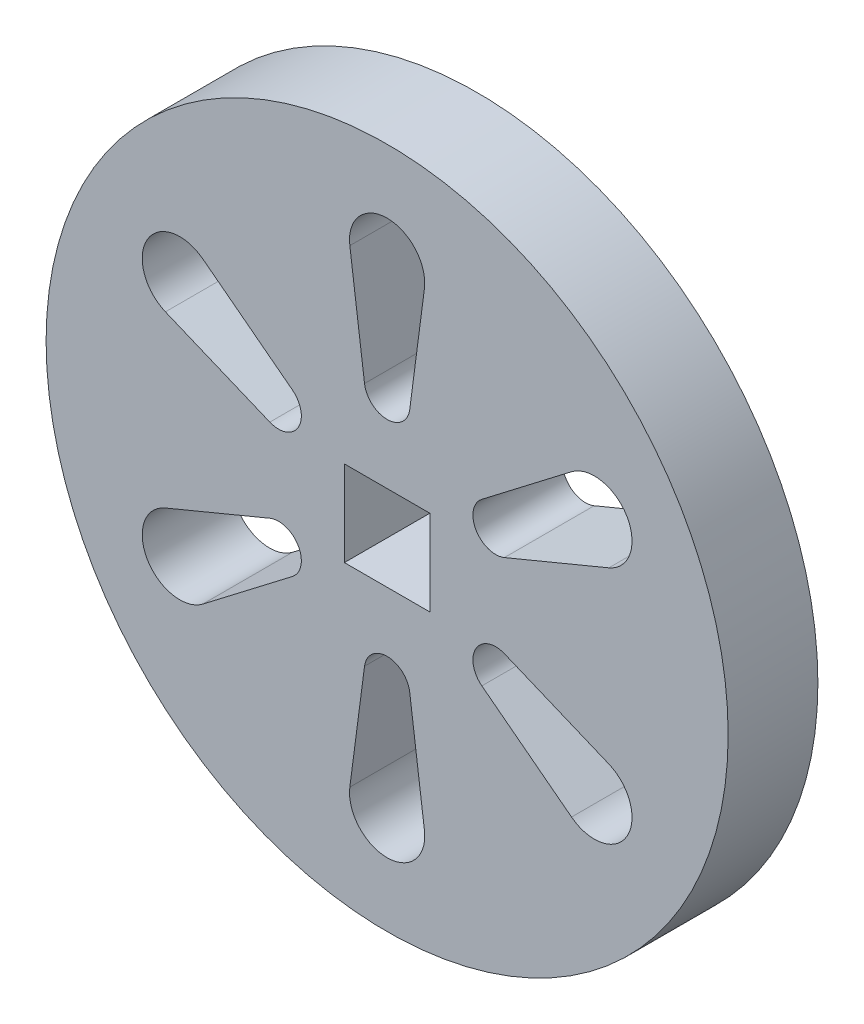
ISO-10303-21;
HEADER;
FILE_DESCRIPTION(('STEP AP214'),'2;1');
FILE_NAME('part.step','',(''),(''),'','','');
FILE_SCHEMA(('AUTOMOTIVE_DESIGN { 1 0 10303 214 1 1 1 1 }'));
ENDSEC;
DATA;
#1=APPLICATION_CONTEXT('core data for automotive mechanical design processes');
#2=APPLICATION_PROTOCOL_DEFINITION('international standard','automotive_design',2000,#1);
#3=PRODUCT_CONTEXT('',#1,'mechanical');
#4=PRODUCT('Part','Part','',(#3));
#5=PRODUCT_RELATED_PRODUCT_CATEGORY('part','',(#4));
#6=PRODUCT_DEFINITION_FORMATION('','',#4);
#7=PRODUCT_DEFINITION_CONTEXT('part definition',#1,'design');
#8=PRODUCT_DEFINITION('design','',#6,#7);
#9=PRODUCT_DEFINITION_SHAPE('','',#8);
#10=(LENGTH_UNIT() NAMED_UNIT(*) SI_UNIT(.MILLI.,.METRE.));
#11=(NAMED_UNIT(*) PLANE_ANGLE_UNIT() SI_UNIT($,.RADIAN.));
#12=(NAMED_UNIT(*) SI_UNIT($,.STERADIAN.) SOLID_ANGLE_UNIT());
#13=UNCERTAINTY_MEASURE_WITH_UNIT(LENGTH_MEASURE(1.E-05),#10,'distance_accuracy_value','');
#14=(GEOMETRIC_REPRESENTATION_CONTEXT(3) GLOBAL_UNCERTAINTY_ASSIGNED_CONTEXT((#13)) GLOBAL_UNIT_ASSIGNED_CONTEXT((#10,
#11,#12)) REPRESENTATION_CONTEXT('',''));
#15=CARTESIAN_POINT('',(0.,0.,0.));
#16=DIRECTION('',(0.,0.,1.));
#17=DIRECTION('',(1.,0.,0.));
#18=AXIS2_PLACEMENT_3D('',#15,#16,#17);
#19=CARTESIAN_POINT('',(0.,0.,10.));
#20=DIRECTION('',(0.,0.,1.));
#21=DIRECTION('',(1.,0.,0.));
#22=AXIS2_PLACEMENT_3D('',#19,#20,#21);
#23=PLANE('',#22);
#24=DIRECTION('',(0.,1.,0.));
#25=VECTOR('',#24,1.);
#26=CARTESIAN_POINT('',(4.7625,4.7625,10.));
#27=LINE('',#26,#25);
#28=CARTESIAN_POINT('',(4.7625,-4.7625,10.));
#29=VERTEX_POINT('',#28);
#30=CARTESIAN_POINT('',(4.7625,4.7625,10.));
#31=VERTEX_POINT('',#30);
#32=EDGE_CURVE('E411',#29,#31,#27,.T.);
#33=ORIENTED_EDGE('',*,*,#32,.F.);
#34=DIRECTION('',(1.,0.,0.));
#35=VECTOR('',#34,1.);
#36=CARTESIAN_POINT('',(-4.7625,-4.7625,10.));
#37=LINE('',#36,#35);
#38=CARTESIAN_POINT('',(-4.7625,-4.7625,10.));
#39=VERTEX_POINT('',#38);
#40=EDGE_CURVE('E303',#39,#29,#37,.T.);
#41=ORIENTED_EDGE('',*,*,#40,.F.);
#42=DIRECTION('',(0.,-1.,0.));
#43=VECTOR('',#42,1.);
#44=CARTESIAN_POINT('',(-4.7625,4.7625,10.));
#45=LINE('',#44,#43);
#46=CARTESIAN_POINT('',(-4.7625,4.7625,10.));
#47=VERTEX_POINT('',#46);
#48=EDGE_CURVE('E421',#47,#39,#45,.T.);
#49=ORIENTED_EDGE('',*,*,#48,.F.);
#50=DIRECTION('',(-1.,0.,0.));
#51=VECTOR('',#50,1.);
#52=CARTESIAN_POINT('',(-4.7625,4.7625,10.));
#53=LINE('',#52,#51);
#54=EDGE_CURVE('E413',#31,#47,#53,.T.);
#55=ORIENTED_EDGE('',*,*,#54,.F.);
#56=EDGE_LOOP('',(#33,#41,#49,#55));
#57=FACE_BOUND('',#56,.T.);
#58=CARTESIAN_POINT('',(0.,0.,10.));
#59=DIRECTION('',(0.,0.,1.));
#60=DIRECTION('',(1.,0.,0.));
#61=AXIS2_PLACEMENT_3D('',#58,#59,#60);
#62=CIRCLE('',#61,38.);
#63=CARTESIAN_POINT('',(38.,0.,10.));
#64=VERTEX_POINT('',#63);
#65=EDGE_CURVE('E12',#64,#64,#62,.T.);
#66=ORIENTED_EDGE('',*,*,#65,.T.);
#67=EDGE_LOOP('',(#66));
#68=FACE_BOUND('',#67,.T.);
#69=DIRECTION('',(0.13,-0.99151399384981,0.));
#70=VECTOR('',#69,1.);
#71=CARTESIAN_POINT('',(-4.15543514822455,26.12517,10.));
#72=LINE('',#71,#70);
#73=CARTESIAN_POINT('',(-4.15543514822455,26.12517,10.));
#74=VERTEX_POINT('',#73);
#75=CARTESIAN_POINT('',(-2.51844554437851,13.6398,10.));
#76=VERTEX_POINT('',#75);
#77=EDGE_CURVE('E871',#74,#76,#72,.T.);
#78=ORIENTED_EDGE('',*,*,#77,.F.);
#79=CARTESIAN_POINT('',(0.,26.67,10.));
#80=DIRECTION('',(0.,0.,-1.));
#81=DIRECTION('',(-1.,0.,0.));
#82=AXIS2_PLACEMENT_3D('',#79,#80,#81);
#83=CIRCLE('',#82,4.191);
#84=CARTESIAN_POINT('',(4.15543514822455,26.12517,10.));
#85=VERTEX_POINT('',#84);
#86=EDGE_CURVE('E824',#74,#85,#83,.T.);
#87=ORIENTED_EDGE('',*,*,#86,.T.);
#88=DIRECTION('',(-0.13,-0.991513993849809,0.));
#89=VECTOR('',#88,1.);
#90=CARTESIAN_POINT('',(4.15543514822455,26.12517,10.));
#91=LINE('',#90,#89);
#92=CARTESIAN_POINT('',(2.51844554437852,13.6398,10.));
#93=VERTEX_POINT('',#92);
#94=EDGE_CURVE('E829',#85,#93,#91,.T.);
#95=ORIENTED_EDGE('',*,*,#94,.T.);
#96=CARTESIAN_POINT('',(0.,13.97,10.));
#97=DIRECTION('',(0.,0.,1.));
#98=DIRECTION('',(1.,0.,0.));
#99=AXIS2_PLACEMENT_3D('',#96,#97,#98);
#100=CIRCLE('',#99,2.54);
#101=EDGE_CURVE('E855',#76,#93,#100,.T.);
#102=ORIENTED_EDGE('',*,*,#101,.F.);
#103=EDGE_LOOP('',(#78,#87,#95,#102));
#104=FACE_BOUND('',#103,.T.);
#105=DIRECTION('',(0.923676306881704,-0.383173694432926,0.));
#106=VECTOR('',#105,1.);
#107=CARTESIAN_POINT('',(-24.7027784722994,9.46387259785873,10.));
#108=LINE('',#107,#106);
#109=CARTESIAN_POINT('',(-24.7027784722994,9.46387259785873,10.));
#110=VERTEX_POINT('',#109);
#111=CARTESIAN_POINT('',(-13.0716360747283,4.63886218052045,10.));
#112=VERTEX_POINT('',#111);
#113=EDGE_CURVE('E403',#110,#112,#108,.T.);
#114=ORIENTED_EDGE('',*,*,#113,.F.);
#115=CARTESIAN_POINT('',(-23.096897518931,13.3349999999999,10.));
#116=DIRECTION('',(0.,0.,-1.));
#117=DIRECTION('',(-0.499999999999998,-0.86602540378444,0.));
#118=AXIS2_PLACEMENT_3D('',#115,#116,#117);
#119=CIRCLE('',#118,4.191);
#120=CARTESIAN_POINT('',(-20.5473433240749,16.6612974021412,10.));
#121=VERTEX_POINT('',#120);
#122=EDGE_CURVE('E825',#110,#121,#119,.T.);
#123=ORIENTED_EDGE('',*,*,#122,.T.);
#124=DIRECTION('',(0.793676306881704,-0.60834029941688,0.));
#125=VECTOR('',#124,1.);
#126=CARTESIAN_POINT('',(-20.5473433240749,16.6612974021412,10.));
#127=LINE('',#126,#125);
#128=CARTESIAN_POINT('',(-10.5531905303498,9.0009378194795,10.));
#129=VERTEX_POINT('',#128);
#130=EDGE_CURVE('E929',#121,#129,#127,.T.);
#131=ORIENTED_EDGE('',*,*,#130,.T.);
#132=CARTESIAN_POINT('',(-12.0983748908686,6.98499999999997,10.));
#133=DIRECTION('',(0.,0.,1.));
#134=DIRECTION('',(0.499999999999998,0.86602540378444,0.));
#135=AXIS2_PLACEMENT_3D('',#132,#133,#134);
#136=CIRCLE('',#135,2.54);
#137=EDGE_CURVE('E908',#112,#129,#136,.T.);
#138=ORIENTED_EDGE('',*,*,#137,.F.);
#139=EDGE_LOOP('',(#114,#123,#131,#138));
#140=FACE_BOUND('',#139,.T.);
#141=DIRECTION('',(0.7936763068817,0.608340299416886,0.));
#142=VECTOR('',#141,1.);
#143=CARTESIAN_POINT('',(-20.5473433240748,-16.6612974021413,10.));
#144=LINE('',#143,#142);
#145=CARTESIAN_POINT('',(-20.5473433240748,-16.6612974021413,10.));
#146=VERTEX_POINT('',#145);
#147=CARTESIAN_POINT('',(-10.5531905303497,-9.00093781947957,10.));
#148=VERTEX_POINT('',#147);
#149=EDGE_CURVE('E234',#146,#148,#144,.T.);
#150=ORIENTED_EDGE('',*,*,#149,.F.);
#151=CARTESIAN_POINT('',(-23.0968975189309,-13.3350000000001,10.));
#152=DIRECTION('',(0.,0.,-1.));
#153=DIRECTION('',(0.500000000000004,-0.866025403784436,0.));
#154=AXIS2_PLACEMENT_3D('',#151,#152,#153);
#155=CIRCLE('',#154,4.191);
#156=CARTESIAN_POINT('',(-24.7027784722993,-9.4638725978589,10.));
#157=VERTEX_POINT('',#156);
#158=EDGE_CURVE('E404',#146,#157,#155,.T.);
#159=ORIENTED_EDGE('',*,*,#158,.T.);
#160=DIRECTION('',(0.923676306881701,0.383173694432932,0.));
#161=VECTOR('',#160,1.);
#162=CARTESIAN_POINT('',(-24.7027784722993,-9.4638725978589,10.));
#163=LINE('',#162,#161);
#164=CARTESIAN_POINT('',(-13.0716360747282,-4.63886218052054,10.));
#165=VERTEX_POINT('',#164);
#166=EDGE_CURVE('E256',#157,#165,#163,.T.);
#167=ORIENTED_EDGE('',*,*,#166,.T.);
#168=CARTESIAN_POINT('',(-12.0983748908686,-6.98500000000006,10.));
#169=DIRECTION('',(0.,0.,1.));
#170=DIRECTION('',(-0.500000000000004,0.866025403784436,0.));
#171=AXIS2_PLACEMENT_3D('',#168,#169,#170);
#172=CIRCLE('',#171,2.54);
#173=EDGE_CURVE('E249',#148,#165,#172,.T.);
#174=ORIENTED_EDGE('',*,*,#173,.F.);
#175=EDGE_LOOP('',(#150,#159,#167,#174));
#176=FACE_BOUND('',#175,.T.);
#177=DIRECTION('',(-0.13,0.99151399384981,0.));
#178=VECTOR('',#177,1.);
#179=CARTESIAN_POINT('',(4.15543514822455,-26.12517,10.));
#180=LINE('',#179,#178);
#181=CARTESIAN_POINT('',(4.15543514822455,-26.12517,10.));
#182=VERTEX_POINT('',#181);
#183=CARTESIAN_POINT('',(2.51844554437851,-13.6398,10.));
#184=VERTEX_POINT('',#183);
#185=EDGE_CURVE('E392',#182,#184,#180,.T.);
#186=ORIENTED_EDGE('',*,*,#185,.F.);
#187=CARTESIAN_POINT('',(0.,-26.67,10.));
#188=DIRECTION('',(0.,0.,-1.));
#189=DIRECTION('',(1.,0.,0.));
#190=AXIS2_PLACEMENT_3D('',#187,#188,#189);
#191=CIRCLE('',#190,4.191);
#192=CARTESIAN_POINT('',(-4.15543514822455,-26.12517,10.));
#193=VERTEX_POINT('',#192);
#194=EDGE_CURVE('E344',#182,#193,#191,.T.);
#195=ORIENTED_EDGE('',*,*,#194,.T.);
#196=DIRECTION('',(0.13,0.991513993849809,0.));
#197=VECTOR('',#196,1.);
#198=CARTESIAN_POINT('',(-4.15543514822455,-26.12517,10.));
#199=LINE('',#198,#197);
#200=CARTESIAN_POINT('',(-2.51844554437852,-13.6398,10.));
#201=VERTEX_POINT('',#200);
#202=EDGE_CURVE('E364',#193,#201,#199,.T.);
#203=ORIENTED_EDGE('',*,*,#202,.T.);
#204=CARTESIAN_POINT('',(0.,-13.97,10.));
#205=DIRECTION('',(0.,0.,1.));
#206=DIRECTION('',(-1.,0.,0.));
#207=AXIS2_PLACEMENT_3D('',#204,#205,#206);
#208=CIRCLE('',#207,2.54);
#209=EDGE_CURVE('E331',#184,#201,#208,.T.);
#210=ORIENTED_EDGE('',*,*,#209,.F.);
#211=EDGE_LOOP('',(#186,#195,#203,#210));
#212=FACE_BOUND('',#211,.T.);
#213=DIRECTION('',(-0.923676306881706,0.383173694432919,0.));
#214=VECTOR('',#213,1.);
#215=CARTESIAN_POINT('',(24.7027784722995,-9.46387259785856,10.));
#216=LINE('',#215,#214);
#217=CARTESIAN_POINT('',(24.7027784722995,-9.46387259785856,10.));
#218=VERTEX_POINT('',#217);
#219=CARTESIAN_POINT('',(13.0716360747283,-4.63886218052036,10.));
#220=VERTEX_POINT('',#219);
#221=EDGE_CURVE('E356',#218,#220,#216,.T.);
#222=ORIENTED_EDGE('',*,*,#221,.F.);
#223=CARTESIAN_POINT('',(23.0968975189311,-13.3349999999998,10.));
#224=DIRECTION('',(0.,0.,-1.));
#225=DIRECTION('',(0.499999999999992,0.866025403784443,0.));
#226=AXIS2_PLACEMENT_3D('',#223,#224,#225);
#227=CIRCLE('',#226,4.191);
#228=CARTESIAN_POINT('',(20.547343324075,-16.661297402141,10.));
#229=VERTEX_POINT('',#228);
#230=EDGE_CURVE('E67',#218,#229,#227,.T.);
#231=ORIENTED_EDGE('',*,*,#230,.T.);
#232=DIRECTION('',(-0.793676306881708,0.608340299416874,0.));
#233=VECTOR('',#232,1.);
#234=CARTESIAN_POINT('',(20.547343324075,-16.661297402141,10.));
#235=LINE('',#234,#233);
#236=CARTESIAN_POINT('',(10.5531905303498,-9.00093781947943,10.));
#237=VERTEX_POINT('',#236);
#238=EDGE_CURVE('E965',#229,#237,#235,.T.);
#239=ORIENTED_EDGE('',*,*,#238,.T.);
#240=CARTESIAN_POINT('',(12.0983748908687,-6.98499999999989,10.));
#241=DIRECTION('',(0.,0.,1.));
#242=DIRECTION('',(-0.499999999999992,-0.866025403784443,0.));
#243=AXIS2_PLACEMENT_3D('',#240,#241,#242);
#244=CIRCLE('',#243,2.54);
#245=EDGE_CURVE('E959',#220,#237,#244,.T.);
#246=ORIENTED_EDGE('',*,*,#245,.F.);
#247=EDGE_LOOP('',(#222,#231,#239,#246));
#248=FACE_BOUND('',#247,.T.);
#249=DIRECTION('',(-0.793676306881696,-0.608340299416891,0.));
#250=VECTOR('',#249,1.);
#251=CARTESIAN_POINT('',(20.5473433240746,16.6612974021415,10.));
#252=LINE('',#251,#250);
#253=CARTESIAN_POINT('',(20.5473433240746,16.6612974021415,10.));
#254=VERTEX_POINT('',#253);
#255=CARTESIAN_POINT('',(10.5531905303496,9.00093781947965,10.));
#256=VERTEX_POINT('',#255);
#257=EDGE_CURVE('E1102',#254,#256,#252,.T.);
#258=ORIENTED_EDGE('',*,*,#257,.F.);
#259=CARTESIAN_POINT('',(23.0968975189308,13.3350000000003,10.));
#260=DIRECTION('',(0.,0.,-1.));
#261=DIRECTION('',(-0.50000000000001,0.866025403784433,0.));
#262=AXIS2_PLACEMENT_3D('',#259,#260,#261);
#263=CIRCLE('',#262,4.191);
#264=CARTESIAN_POINT('',(24.7027784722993,9.46387259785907,10.));
#265=VERTEX_POINT('',#264);
#266=EDGE_CURVE('E59',#254,#265,#263,.T.);
#267=ORIENTED_EDGE('',*,*,#266,.T.);
#268=DIRECTION('',(-0.923676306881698,-0.383173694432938,0.));
#269=VECTOR('',#268,1.);
#270=CARTESIAN_POINT('',(24.7027784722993,9.46387259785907,10.));
#271=LINE('',#270,#269);
#272=CARTESIAN_POINT('',(13.0716360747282,4.63886218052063,10.));
#273=VERTEX_POINT('',#272);
#274=EDGE_CURVE('E1116',#265,#273,#271,.T.);
#275=ORIENTED_EDGE('',*,*,#274,.T.);
#276=CARTESIAN_POINT('',(12.0983748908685,6.98500000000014,10.));
#277=DIRECTION('',(0.,0.,1.));
#278=DIRECTION('',(0.50000000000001,-0.866025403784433,0.));
#279=AXIS2_PLACEMENT_3D('',#276,#277,#278);
#280=CIRCLE('',#279,2.54);
#281=EDGE_CURVE('E1135',#256,#273,#280,.T.);
#282=ORIENTED_EDGE('',*,*,#281,.F.);
#283=EDGE_LOOP('',(#258,#267,#275,#282));
#284=FACE_BOUND('',#283,.T.);
#285=ADVANCED_FACE('F44',(#57,#68,#104,#140,#176,#212,#248,#284),#23,.T.);
#286=CARTESIAN_POINT('',(0.,0.,0.));
#287=DIRECTION('',(0.,0.,1.));
#288=DIRECTION('',(1.,0.,0.));
#289=AXIS2_PLACEMENT_3D('',#286,#287,#288);
#290=PLANE('',#289);
#291=CARTESIAN_POINT('',(23.0968975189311,-13.3349999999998,0.));
#292=DIRECTION('',(0.,0.,-1.));
#293=DIRECTION('',(0.499999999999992,0.866025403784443,0.));
#294=AXIS2_PLACEMENT_3D('',#291,#292,#293);
#295=CIRCLE('',#294,4.191);
#296=CARTESIAN_POINT('',(24.7027784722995,-9.46387259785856,0.));
#297=VERTEX_POINT('',#296);
#298=CARTESIAN_POINT('',(20.547343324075,-16.661297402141,0.));
#299=VERTEX_POINT('',#298);
#300=EDGE_CURVE('E393',#297,#299,#295,.T.);
#301=ORIENTED_EDGE('',*,*,#300,.F.);
#302=DIRECTION('',(-0.923676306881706,0.383173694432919,0.));
#303=VECTOR('',#302,1.);
#304=CARTESIAN_POINT('',(24.7027784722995,-9.46387259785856,0.));
#305=LINE('',#304,#303);
#306=CARTESIAN_POINT('',(13.0716360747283,-4.63886218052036,0.));
#307=VERTEX_POINT('',#306);
#308=EDGE_CURVE('E1151',#297,#307,#305,.T.);
#309=ORIENTED_EDGE('',*,*,#308,.T.);
#310=CARTESIAN_POINT('',(12.0983748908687,-6.98499999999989,0.));
#311=DIRECTION('',(0.,0.,1.));
#312=DIRECTION('',(-0.499999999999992,-0.866025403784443,0.));
#313=AXIS2_PLACEMENT_3D('',#310,#311,#312);
#314=CIRCLE('',#313,2.54);
#315=CARTESIAN_POINT('',(10.5531905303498,-9.00093781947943,0.));
#316=VERTEX_POINT('',#315);
#317=EDGE_CURVE('E958',#307,#316,#314,.T.);
#318=ORIENTED_EDGE('',*,*,#317,.T.);
#319=DIRECTION('',(-0.793676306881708,0.608340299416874,0.));
#320=VECTOR('',#319,1.);
#321=CARTESIAN_POINT('',(20.547343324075,-16.661297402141,0.));
#322=LINE('',#321,#320);
#323=EDGE_CURVE('E974',#299,#316,#322,.T.);
#324=ORIENTED_EDGE('',*,*,#323,.F.);
#325=EDGE_LOOP('',(#301,#309,#318,#324));
#326=FACE_BOUND('',#325,.T.);
#327=CARTESIAN_POINT('',(-23.0968975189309,-13.3350000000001,0.));
#328=DIRECTION('',(0.,0.,-1.));
#329=DIRECTION('',(0.500000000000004,-0.866025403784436,0.));
#330=AXIS2_PLACEMENT_3D('',#327,#328,#329);
#331=CIRCLE('',#330,4.191);
#332=CARTESIAN_POINT('',(-20.5473433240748,-16.6612974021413,0.));
#333=VERTEX_POINT('',#332);
#334=CARTESIAN_POINT('',(-24.7027784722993,-9.4638725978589,0.));
#335=VERTEX_POINT('',#334);
#336=EDGE_CURVE('E399',#333,#335,#331,.T.);
#337=ORIENTED_EDGE('',*,*,#336,.F.);
#338=DIRECTION('',(0.7936763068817,0.608340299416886,0.));
#339=VECTOR('',#338,1.);
#340=CARTESIAN_POINT('',(-20.5473433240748,-16.6612974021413,0.));
#341=LINE('',#340,#339);
#342=CARTESIAN_POINT('',(-10.5531905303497,-9.00093781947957,0.));
#343=VERTEX_POINT('',#342);
#344=EDGE_CURVE('E244',#333,#343,#341,.T.);
#345=ORIENTED_EDGE('',*,*,#344,.T.);
#346=CARTESIAN_POINT('',(-12.0983748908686,-6.98500000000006,0.));
#347=DIRECTION('',(0.,0.,1.));
#348=DIRECTION('',(-0.500000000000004,0.866025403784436,0.));
#349=AXIS2_PLACEMENT_3D('',#346,#347,#348);
#350=CIRCLE('',#349,2.54);
#351=CARTESIAN_POINT('',(-13.0716360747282,-4.63886218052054,0.));
#352=VERTEX_POINT('',#351);
#353=EDGE_CURVE('E252',#343,#352,#350,.T.);
#354=ORIENTED_EDGE('',*,*,#353,.T.);
#355=DIRECTION('',(0.923676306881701,0.383173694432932,0.));
#356=VECTOR('',#355,1.);
#357=CARTESIAN_POINT('',(-24.7027784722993,-9.4638725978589,0.));
#358=LINE('',#357,#356);
#359=EDGE_CURVE('E287',#335,#352,#358,.T.);
#360=ORIENTED_EDGE('',*,*,#359,.F.);
#361=EDGE_LOOP('',(#337,#345,#354,#360));
#362=FACE_BOUND('',#361,.T.);
#363=CARTESIAN_POINT('',(0.,26.67,0.));
#364=DIRECTION('',(0.,0.,-1.));
#365=DIRECTION('',(-1.,0.,0.));
#366=AXIS2_PLACEMENT_3D('',#363,#364,#365);
#367=CIRCLE('',#366,4.191);
#368=CARTESIAN_POINT('',(-4.15543514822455,26.12517,0.));
#369=VERTEX_POINT('',#368);
#370=CARTESIAN_POINT('',(4.15543514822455,26.12517,0.));
#371=VERTEX_POINT('',#370);
#372=EDGE_CURVE('E837',#369,#371,#367,.T.);
#373=ORIENTED_EDGE('',*,*,#372,.F.);
#374=DIRECTION('',(0.13,-0.99151399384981,0.));
#375=VECTOR('',#374,1.);
#376=CARTESIAN_POINT('',(-4.15543514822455,26.12517,0.));
#377=LINE('',#376,#375);
#378=CARTESIAN_POINT('',(-2.51844554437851,13.6398,0.));
#379=VERTEX_POINT('',#378);
#380=EDGE_CURVE('E850',#369,#379,#377,.T.);
#381=ORIENTED_EDGE('',*,*,#380,.T.);
#382=CARTESIAN_POINT('',(0.,13.97,0.));
#383=DIRECTION('',(0.,0.,1.));
#384=DIRECTION('',(1.,0.,0.));
#385=AXIS2_PLACEMENT_3D('',#382,#383,#384);
#386=CIRCLE('',#385,2.54);
#387=CARTESIAN_POINT('',(2.51844554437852,13.6398,0.));
#388=VERTEX_POINT('',#387);
#389=EDGE_CURVE('E863',#379,#388,#386,.T.);
#390=ORIENTED_EDGE('',*,*,#389,.T.);
#391=DIRECTION('',(-0.13,-0.991513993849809,0.));
#392=VECTOR('',#391,1.);
#393=CARTESIAN_POINT('',(4.15543514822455,26.12517,0.));
#394=LINE('',#393,#392);
#395=EDGE_CURVE('E866',#371,#388,#394,.T.);
#396=ORIENTED_EDGE('',*,*,#395,.F.);
#397=EDGE_LOOP('',(#373,#381,#390,#396));
#398=FACE_BOUND('',#397,.T.);
#399=DIRECTION('',(1.,0.,0.));
#400=VECTOR('',#399,1.);
#401=CARTESIAN_POINT('',(-4.7625,-4.7625,0.));
#402=LINE('',#401,#400);
#403=CARTESIAN_POINT('',(-4.7625,-4.7625,0.));
#404=VERTEX_POINT('',#403);
#405=CARTESIAN_POINT('',(4.7625,-4.7625,0.));
#406=VERTEX_POINT('',#405);
#407=EDGE_CURVE('E415',#404,#406,#402,.T.);
#408=ORIENTED_EDGE('',*,*,#407,.T.);
#409=DIRECTION('',(0.,1.,0.));
#410=VECTOR('',#409,1.);
#411=CARTESIAN_POINT('',(4.7625,4.7625,0.));
#412=LINE('',#411,#410);
#413=CARTESIAN_POINT('',(4.7625,4.7625,0.));
#414=VERTEX_POINT('',#413);
#415=EDGE_CURVE('E430',#406,#414,#412,.T.);
#416=ORIENTED_EDGE('',*,*,#415,.T.);
#417=DIRECTION('',(-1.,0.,0.));
#418=VECTOR('',#417,1.);
#419=CARTESIAN_POINT('',(-4.7625,4.7625,0.));
#420=LINE('',#419,#418);
#421=CARTESIAN_POINT('',(-4.7625,4.7625,0.));
#422=VERTEX_POINT('',#421);
#423=EDGE_CURVE('E434',#414,#422,#420,.T.);
#424=ORIENTED_EDGE('',*,*,#423,.T.);
#425=DIRECTION('',(0.,-1.,0.));
#426=VECTOR('',#425,1.);
#427=CARTESIAN_POINT('',(-4.7625,4.7625,0.));
#428=LINE('',#427,#426);
#429=EDGE_CURVE('E440',#422,#404,#428,.T.);
#430=ORIENTED_EDGE('',*,*,#429,.T.);
#431=EDGE_LOOP('',(#408,#416,#424,#430));
#432=FACE_BOUND('',#431,.T.);
#433=CARTESIAN_POINT('',(0.,0.,0.));
#434=DIRECTION('',(0.,0.,1.));
#435=DIRECTION('',(1.,0.,0.));
#436=AXIS2_PLACEMENT_3D('',#433,#434,#435);
#437=CIRCLE('',#436,38.);
#438=CARTESIAN_POINT('',(38.,0.,0.));
#439=VERTEX_POINT('',#438);
#440=EDGE_CURVE('E48',#439,#439,#437,.T.);
#441=ORIENTED_EDGE('',*,*,#440,.F.);
#442=EDGE_LOOP('',(#441));
#443=FACE_BOUND('',#442,.T.);
#444=CARTESIAN_POINT('',(-23.096897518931,13.3349999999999,0.));
#445=DIRECTION('',(0.,0.,-1.));
#446=DIRECTION('',(-0.499999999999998,-0.86602540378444,0.));
#447=AXIS2_PLACEMENT_3D('',#444,#445,#446);
#448=CIRCLE('',#447,4.191);
#449=CARTESIAN_POINT('',(-24.7027784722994,9.46387259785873,0.));
#450=VERTEX_POINT('',#449);
#451=CARTESIAN_POINT('',(-20.5473433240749,16.6612974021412,0.));
#452=VERTEX_POINT('',#451);
#453=EDGE_CURVE('E817',#450,#452,#448,.T.);
#454=ORIENTED_EDGE('',*,*,#453,.F.);
#455=DIRECTION('',(0.923676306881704,-0.383173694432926,0.));
#456=VECTOR('',#455,1.);
#457=CARTESIAN_POINT('',(-24.7027784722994,9.46387259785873,0.));
#458=LINE('',#457,#456);
#459=CARTESIAN_POINT('',(-13.0716360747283,4.63886218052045,0.));
#460=VERTEX_POINT('',#459);
#461=EDGE_CURVE('E819',#450,#460,#458,.T.);
#462=ORIENTED_EDGE('',*,*,#461,.T.);
#463=CARTESIAN_POINT('',(-12.0983748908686,6.98499999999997,0.));
#464=DIRECTION('',(0.,0.,1.));
#465=DIRECTION('',(0.499999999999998,0.86602540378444,0.));
#466=AXIS2_PLACEMENT_3D('',#463,#464,#465);
#467=CIRCLE('',#466,2.54);
#468=CARTESIAN_POINT('',(-10.5531905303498,9.0009378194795,0.));
#469=VERTEX_POINT('',#468);
#470=EDGE_CURVE('E934',#460,#469,#467,.T.);
#471=ORIENTED_EDGE('',*,*,#470,.T.);
#472=DIRECTION('',(0.793676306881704,-0.60834029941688,0.));
#473=VECTOR('',#472,1.);
#474=CARTESIAN_POINT('',(-20.5473433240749,16.6612974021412,0.));
#475=LINE('',#474,#473);
#476=EDGE_CURVE('E821',#452,#469,#475,.T.);
#477=ORIENTED_EDGE('',*,*,#476,.F.);
#478=EDGE_LOOP('',(#454,#462,#471,#477));
#479=FACE_BOUND('',#478,.T.);
#480=CARTESIAN_POINT('',(0.,-26.67,0.));
#481=DIRECTION('',(0.,0.,-1.));
#482=DIRECTION('',(1.,0.,0.));
#483=AXIS2_PLACEMENT_3D('',#480,#481,#482);
#484=CIRCLE('',#483,4.191);
#485=CARTESIAN_POINT('',(4.15543514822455,-26.12517,0.));
#486=VERTEX_POINT('',#485);
#487=CARTESIAN_POINT('',(-4.15543514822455,-26.12517,0.));
#488=VERTEX_POINT('',#487);
#489=EDGE_CURVE('E245',#486,#488,#484,.T.);
#490=ORIENTED_EDGE('',*,*,#489,.F.);
#491=DIRECTION('',(-0.13,0.99151399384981,0.));
#492=VECTOR('',#491,1.);
#493=CARTESIAN_POINT('',(4.15543514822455,-26.12517,0.));
#494=LINE('',#493,#492);
#495=CARTESIAN_POINT('',(2.51844554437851,-13.6398,0.));
#496=VERTEX_POINT('',#495);
#497=EDGE_CURVE('E325',#486,#496,#494,.T.);
#498=ORIENTED_EDGE('',*,*,#497,.T.);
#499=CARTESIAN_POINT('',(0.,-13.97,0.));
#500=DIRECTION('',(0.,0.,1.));
#501=DIRECTION('',(-1.,0.,0.));
#502=AXIS2_PLACEMENT_3D('',#499,#500,#501);
#503=CIRCLE('',#502,2.54);
#504=CARTESIAN_POINT('',(-2.51844554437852,-13.6398,0.));
#505=VERTEX_POINT('',#504);
#506=EDGE_CURVE('E368',#496,#505,#503,.T.);
#507=ORIENTED_EDGE('',*,*,#506,.T.);
#508=DIRECTION('',(0.13,0.991513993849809,0.));
#509=VECTOR('',#508,1.);
#510=CARTESIAN_POINT('',(-4.15543514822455,-26.12517,0.));
#511=LINE('',#510,#509);
#512=EDGE_CURVE('E349',#488,#505,#511,.T.);
#513=ORIENTED_EDGE('',*,*,#512,.F.);
#514=EDGE_LOOP('',(#490,#498,#507,#513));
#515=FACE_BOUND('',#514,.T.);
#516=CARTESIAN_POINT('',(23.0968975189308,13.3350000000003,0.));
#517=DIRECTION('',(0.,0.,-1.));
#518=DIRECTION('',(-0.50000000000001,0.866025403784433,0.));
#519=AXIS2_PLACEMENT_3D('',#516,#517,#518);
#520=CIRCLE('',#519,4.191);
#521=CARTESIAN_POINT('',(20.5473433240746,16.6612974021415,0.));
#522=VERTEX_POINT('',#521);
#523=CARTESIAN_POINT('',(24.7027784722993,9.46387259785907,0.));
#524=VERTEX_POINT('',#523);
#525=EDGE_CURVE('E917',#522,#524,#520,.T.);
#526=ORIENTED_EDGE('',*,*,#525,.F.);
#527=DIRECTION('',(-0.793676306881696,-0.608340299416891,0.));
#528=VECTOR('',#527,1.);
#529=CARTESIAN_POINT('',(20.5473433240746,16.6612974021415,0.));
#530=LINE('',#529,#528);
#531=CARTESIAN_POINT('',(10.5531905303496,9.00093781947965,0.));
#532=VERTEX_POINT('',#531);
#533=EDGE_CURVE('E1105',#522,#532,#530,.T.);
#534=ORIENTED_EDGE('',*,*,#533,.T.);
#535=CARTESIAN_POINT('',(12.0983748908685,6.98500000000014,0.));
#536=DIRECTION('',(0.,0.,1.));
#537=DIRECTION('',(0.50000000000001,-0.866025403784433,0.));
#538=AXIS2_PLACEMENT_3D('',#535,#536,#537);
#539=CIRCLE('',#538,2.54);
#540=CARTESIAN_POINT('',(13.0716360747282,4.63886218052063,0.));
#541=VERTEX_POINT('',#540);
#542=EDGE_CURVE('E1122',#532,#541,#539,.T.);
#543=ORIENTED_EDGE('',*,*,#542,.T.);
#544=DIRECTION('',(-0.923676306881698,-0.383173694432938,0.));
#545=VECTOR('',#544,1.);
#546=CARTESIAN_POINT('',(24.7027784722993,9.46387259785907,0.));
#547=LINE('',#546,#545);
#548=EDGE_CURVE('E1127',#524,#541,#547,.T.);
#549=ORIENTED_EDGE('',*,*,#548,.F.);
#550=EDGE_LOOP('',(#526,#534,#543,#549));
#551=FACE_BOUND('',#550,.T.);
#552=ADVANCED_FACE('F382',(#326,#362,#398,#432,#443,#479,#515,#551),#290,.F.);
#553=CARTESIAN_POINT('',(0.,0.,10.));
#554=DIRECTION('',(0.,0.,-1.));
#555=DIRECTION('',(-1.,0.,0.));
#556=AXIS2_PLACEMENT_3D('',#553,#554,#555);
#557=CYLINDRICAL_SURFACE('',#556,38.);
#558=ORIENTED_EDGE('',*,*,#65,.F.);
#559=EDGE_LOOP('',(#558));
#560=FACE_BOUND('',#559,.T.);
#561=ORIENTED_EDGE('',*,*,#440,.T.);
#562=EDGE_LOOP('',(#561));
#563=FACE_BOUND('',#562,.T.);
#564=ADVANCED_FACE('F46',(#560,#563),#557,.T.);
#565=CARTESIAN_POINT('',(4.7625,4.7625,0.));
#566=DIRECTION('',(1.,0.,0.));
#567=DIRECTION('',(0.,1.,0.));
#568=AXIS2_PLACEMENT_3D('',#565,#566,#567);
#569=PLANE('',#568);
#570=ORIENTED_EDGE('',*,*,#32,.T.);
#571=DIRECTION('',(0.,0.,1.));
#572=VECTOR('',#571,1.);
#573=CARTESIAN_POINT('',(4.7625,4.7625,0.));
#574=LINE('',#573,#572);
#575=EDGE_CURVE('E313',#414,#31,#574,.T.);
#576=ORIENTED_EDGE('',*,*,#575,.F.);
#577=ORIENTED_EDGE('',*,*,#415,.F.);
#578=DIRECTION('',(0.,0.,1.));
#579=VECTOR('',#578,1.);
#580=CARTESIAN_POINT('',(4.7625,-4.7625,0.));
#581=LINE('',#580,#579);
#582=EDGE_CURVE('E299',#406,#29,#581,.T.);
#583=ORIENTED_EDGE('',*,*,#582,.T.);
#584=EDGE_LOOP('',(#570,#576,#577,#583));
#585=FACE_BOUND('',#584,.T.);
#586=ADVANCED_FACE('F471',(#585),#569,.F.);
#587=CARTESIAN_POINT('',(-4.7625,-4.7625,0.));
#588=DIRECTION('',(0.,-1.,0.));
#589=DIRECTION('',(0.,0.,-1.));
#590=AXIS2_PLACEMENT_3D('',#587,#588,#589);
#591=PLANE('',#590);
#592=ORIENTED_EDGE('',*,*,#40,.T.);
#593=ORIENTED_EDGE('',*,*,#582,.F.);
#594=ORIENTED_EDGE('',*,*,#407,.F.);
#595=DIRECTION('',(0.,0.,1.));
#596=VECTOR('',#595,1.);
#597=CARTESIAN_POINT('',(-4.7625,-4.7625,0.));
#598=LINE('',#597,#596);
#599=EDGE_CURVE('E302',#404,#39,#598,.T.);
#600=ORIENTED_EDGE('',*,*,#599,.T.);
#601=EDGE_LOOP('',(#592,#593,#594,#600));
#602=FACE_BOUND('',#601,.T.);
#603=ADVANCED_FACE('F473',(#602),#591,.F.);
#604=CARTESIAN_POINT('',(-4.7625,4.7625,0.));
#605=DIRECTION('',(-1.,0.,0.));
#606=DIRECTION('',(0.,0.,1.));
#607=AXIS2_PLACEMENT_3D('',#604,#605,#606);
#608=PLANE('',#607);
#609=ORIENTED_EDGE('',*,*,#48,.T.);
#610=ORIENTED_EDGE('',*,*,#599,.F.);
#611=ORIENTED_EDGE('',*,*,#429,.F.);
#612=DIRECTION('',(0.,0.,1.));
#613=VECTOR('',#612,1.);
#614=CARTESIAN_POINT('',(-4.7625,4.7625,0.));
#615=LINE('',#614,#613);
#616=EDGE_CURVE('E309',#422,#47,#615,.T.);
#617=ORIENTED_EDGE('',*,*,#616,.T.);
#618=EDGE_LOOP('',(#609,#610,#611,#617));
#619=FACE_BOUND('',#618,.T.);
#620=ADVANCED_FACE('F469',(#619),#608,.F.);
#621=CARTESIAN_POINT('',(-4.7625,4.7625,0.));
#622=DIRECTION('',(0.,1.,0.));
#623=DIRECTION('',(0.,0.,1.));
#624=AXIS2_PLACEMENT_3D('',#621,#622,#623);
#625=PLANE('',#624);
#626=ORIENTED_EDGE('',*,*,#54,.T.);
#627=ORIENTED_EDGE('',*,*,#616,.F.);
#628=ORIENTED_EDGE('',*,*,#423,.F.);
#629=ORIENTED_EDGE('',*,*,#575,.T.);
#630=EDGE_LOOP('',(#626,#627,#628,#629));
#631=FACE_BOUND('',#630,.T.);
#632=ADVANCED_FACE('F458',(#631),#625,.F.);
#633=CARTESIAN_POINT('',(0.,26.67,0.));
#634=DIRECTION('',(0.,0.,1.));
#635=DIRECTION('',(1.,0.,0.));
#636=AXIS2_PLACEMENT_3D('',#633,#634,#635);
#637=CYLINDRICAL_SURFACE('',#636,4.191);
#638=ORIENTED_EDGE('',*,*,#86,.F.);
#639=DIRECTION('',(0.,0.,1.));
#640=VECTOR('',#639,1.);
#641=CARTESIAN_POINT('',(-4.15543514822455,26.12517,0.));
#642=LINE('',#641,#640);
#643=EDGE_CURVE('E883',#369,#74,#642,.T.);
#644=ORIENTED_EDGE('',*,*,#643,.F.);
#645=ORIENTED_EDGE('',*,*,#372,.T.);
#646=DIRECTION('',(0.,0.,1.));
#647=VECTOR('',#646,1.);
#648=CARTESIAN_POINT('',(4.15543514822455,26.12517,0.));
#649=LINE('',#648,#647);
#650=EDGE_CURVE('E414',#371,#85,#649,.T.);
#651=ORIENTED_EDGE('',*,*,#650,.T.);
#652=EDGE_LOOP('',(#638,#644,#645,#651));
#653=FACE_BOUND('',#652,.T.);
#654=ADVANCED_FACE('F490',(#653),#637,.F.);
#655=CARTESIAN_POINT('',(4.15543514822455,26.12517,0.));
#656=DIRECTION('',(-0.99151399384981,0.13,0.));
#657=DIRECTION('',(-0.13,-0.99151399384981,0.));
#658=AXIS2_PLACEMENT_3D('',#655,#656,#657);
#659=PLANE('',#658);
#660=ORIENTED_EDGE('',*,*,#94,.F.);
#661=ORIENTED_EDGE('',*,*,#650,.F.);
#662=ORIENTED_EDGE('',*,*,#395,.T.);
#663=DIRECTION('',(0.,0.,1.));
#664=VECTOR('',#663,1.);
#665=CARTESIAN_POINT('',(2.51844554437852,13.6398,0.));
#666=LINE('',#665,#664);
#667=EDGE_CURVE('E898',#388,#93,#666,.T.);
#668=ORIENTED_EDGE('',*,*,#667,.T.);
#669=EDGE_LOOP('',(#660,#661,#662,#668));
#670=FACE_BOUND('',#669,.T.);
#671=ADVANCED_FACE('F494',(#670),#659,.T.);
#672=CARTESIAN_POINT('',(0.,13.97,0.));
#673=DIRECTION('',(0.,0.,1.));
#674=DIRECTION('',(1.,0.,0.));
#675=AXIS2_PLACEMENT_3D('',#672,#673,#674);
#676=CYLINDRICAL_SURFACE('',#675,2.54);
#677=ORIENTED_EDGE('',*,*,#101,.T.);
#678=ORIENTED_EDGE('',*,*,#667,.F.);
#679=ORIENTED_EDGE('',*,*,#389,.F.);
#680=DIRECTION('',(0.,0.,1.));
#681=VECTOR('',#680,1.);
#682=CARTESIAN_POINT('',(-2.51844554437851,13.6398,0.));
#683=LINE('',#682,#681);
#684=EDGE_CURVE('E886',#379,#76,#683,.T.);
#685=ORIENTED_EDGE('',*,*,#684,.T.);
#686=EDGE_LOOP('',(#677,#678,#679,#685));
#687=FACE_BOUND('',#686,.T.);
#688=ADVANCED_FACE('F499',(#687),#676,.F.);
#689=CARTESIAN_POINT('',(-4.15543514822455,26.12517,0.));
#690=DIRECTION('',(-0.99151399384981,-0.13,0.));
#691=DIRECTION('',(0.13,-0.99151399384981,0.));
#692=AXIS2_PLACEMENT_3D('',#689,#690,#691);
#693=PLANE('',#692);
#694=ORIENTED_EDGE('',*,*,#77,.T.);
#695=ORIENTED_EDGE('',*,*,#684,.F.);
#696=ORIENTED_EDGE('',*,*,#380,.F.);
#697=ORIENTED_EDGE('',*,*,#643,.T.);
#698=EDGE_LOOP('',(#694,#695,#696,#697));
#699=FACE_BOUND('',#698,.T.);
#700=ADVANCED_FACE('F505',(#699),#693,.F.);
#701=CARTESIAN_POINT('',(-23.096897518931,13.3349999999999,0.));
#702=DIRECTION('',(0.,0.,1.));
#703=DIRECTION('',(0.499999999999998,0.86602540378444,0.));
#704=AXIS2_PLACEMENT_3D('',#701,#702,#703);
#705=CYLINDRICAL_SURFACE('',#704,4.191);
#706=ORIENTED_EDGE('',*,*,#122,.F.);
#707=DIRECTION('',(0.,0.,1.));
#708=VECTOR('',#707,1.);
#709=CARTESIAN_POINT('',(-24.7027784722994,9.46387259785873,0.));
#710=LINE('',#709,#708);
#711=EDGE_CURVE('E943',#450,#110,#710,.T.);
#712=ORIENTED_EDGE('',*,*,#711,.F.);
#713=ORIENTED_EDGE('',*,*,#453,.T.);
#714=DIRECTION('',(0.,0.,1.));
#715=VECTOR('',#714,1.);
#716=CARTESIAN_POINT('',(-20.5473433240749,16.6612974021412,0.));
#717=LINE('',#716,#715);
#718=EDGE_CURVE('E933',#452,#121,#717,.T.);
#719=ORIENTED_EDGE('',*,*,#718,.T.);
#720=EDGE_LOOP('',(#706,#712,#713,#719));
#721=FACE_BOUND('',#720,.T.);
#722=ADVANCED_FACE('F509',(#721),#705,.F.);
#723=CARTESIAN_POINT('',(-20.5473433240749,16.6612974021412,0.));
#724=DIRECTION('',(-0.60834029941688,-0.793676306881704,0.));
#725=DIRECTION('',(0.793676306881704,-0.60834029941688,0.));
#726=AXIS2_PLACEMENT_3D('',#723,#724,#725);
#727=PLANE('',#726);
#728=ORIENTED_EDGE('',*,*,#130,.F.);
#729=ORIENTED_EDGE('',*,*,#718,.F.);
#730=ORIENTED_EDGE('',*,*,#476,.T.);
#731=DIRECTION('',(0.,0.,1.));
#732=VECTOR('',#731,1.);
#733=CARTESIAN_POINT('',(-10.5531905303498,9.0009378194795,0.));
#734=LINE('',#733,#732);
#735=EDGE_CURVE('E946',#469,#129,#734,.T.);
#736=ORIENTED_EDGE('',*,*,#735,.T.);
#737=EDGE_LOOP('',(#728,#729,#730,#736));
#738=FACE_BOUND('',#737,.T.);
#739=ADVANCED_FACE('F513',(#738),#727,.T.);
#740=CARTESIAN_POINT('',(-12.0983748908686,6.98499999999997,0.));
#741=DIRECTION('',(0.,0.,1.));
#742=DIRECTION('',(0.499999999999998,0.86602540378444,0.));
#743=AXIS2_PLACEMENT_3D('',#740,#741,#742);
#744=CYLINDRICAL_SURFACE('',#743,2.54);
#745=ORIENTED_EDGE('',*,*,#137,.T.);
#746=ORIENTED_EDGE('',*,*,#735,.F.);
#747=ORIENTED_EDGE('',*,*,#470,.F.);
#748=DIRECTION('',(0.,0.,1.));
#749=VECTOR('',#748,1.);
#750=CARTESIAN_POINT('',(-13.0716360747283,4.63886218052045,0.));
#751=LINE('',#750,#749);
#752=EDGE_CURVE('E913',#460,#112,#751,.T.);
#753=ORIENTED_EDGE('',*,*,#752,.T.);
#754=EDGE_LOOP('',(#745,#746,#747,#753));
#755=FACE_BOUND('',#754,.T.);
#756=ADVANCED_FACE('F517',(#755),#744,.F.);
#757=CARTESIAN_POINT('',(-24.7027784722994,9.46387259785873,0.));
#758=DIRECTION('',(-0.383173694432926,-0.923676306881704,0.));
#759=DIRECTION('',(0.923676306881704,-0.383173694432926,0.));
#760=AXIS2_PLACEMENT_3D('',#757,#758,#759);
#761=PLANE('',#760);
#762=ORIENTED_EDGE('',*,*,#113,.T.);
#763=ORIENTED_EDGE('',*,*,#752,.F.);
#764=ORIENTED_EDGE('',*,*,#461,.F.);
#765=ORIENTED_EDGE('',*,*,#711,.T.);
#766=EDGE_LOOP('',(#762,#763,#764,#765));
#767=FACE_BOUND('',#766,.T.);
#768=ADVANCED_FACE('F521',(#767),#761,.F.);
#769=CARTESIAN_POINT('',(-23.0968975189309,-13.3350000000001,0.));
#770=DIRECTION('',(0.,0.,1.));
#771=DIRECTION('',(-0.500000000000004,0.866025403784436,0.));
#772=AXIS2_PLACEMENT_3D('',#769,#770,#771);
#773=CYLINDRICAL_SURFACE('',#772,4.191);
#774=ORIENTED_EDGE('',*,*,#158,.F.);
#775=DIRECTION('',(0.,0.,1.));
#776=VECTOR('',#775,1.);
#777=CARTESIAN_POINT('',(-20.5473433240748,-16.6612974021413,0.));
#778=LINE('',#777,#776);
#779=EDGE_CURVE('E240',#333,#146,#778,.T.);
#780=ORIENTED_EDGE('',*,*,#779,.F.);
#781=ORIENTED_EDGE('',*,*,#336,.T.);
#782=DIRECTION('',(0.,0.,1.));
#783=VECTOR('',#782,1.);
#784=CARTESIAN_POINT('',(-24.7027784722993,-9.4638725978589,0.));
#785=LINE('',#784,#783);
#786=EDGE_CURVE('E284',#335,#157,#785,.T.);
#787=ORIENTED_EDGE('',*,*,#786,.T.);
#788=EDGE_LOOP('',(#774,#780,#781,#787));
#789=FACE_BOUND('',#788,.T.);
#790=ADVANCED_FACE('F525',(#789),#773,.F.);
#791=CARTESIAN_POINT('',(-24.7027784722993,-9.4638725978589,0.));
#792=DIRECTION('',(0.383173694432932,-0.923676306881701,0.));
#793=DIRECTION('',(0.923676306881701,0.383173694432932,0.));
#794=AXIS2_PLACEMENT_3D('',#791,#792,#793);
#795=PLANE('',#794);
#796=ORIENTED_EDGE('',*,*,#166,.F.);
#797=ORIENTED_EDGE('',*,*,#786,.F.);
#798=ORIENTED_EDGE('',*,*,#359,.T.);
#799=DIRECTION('',(0.,0.,1.));
#800=VECTOR('',#799,1.);
#801=CARTESIAN_POINT('',(-13.0716360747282,-4.63886218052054,0.));
#802=LINE('',#801,#800);
#803=EDGE_CURVE('E257',#352,#165,#802,.T.);
#804=ORIENTED_EDGE('',*,*,#803,.T.);
#805=EDGE_LOOP('',(#796,#797,#798,#804));
#806=FACE_BOUND('',#805,.T.);
#807=ADVANCED_FACE('F568',(#806),#795,.T.);
#808=CARTESIAN_POINT('',(-12.0983748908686,-6.98500000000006,0.));
#809=DIRECTION('',(0.,0.,1.));
#810=DIRECTION('',(-0.500000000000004,0.866025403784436,0.));
#811=AXIS2_PLACEMENT_3D('',#808,#809,#810);
#812=CYLINDRICAL_SURFACE('',#811,2.54);
#813=ORIENTED_EDGE('',*,*,#173,.T.);
#814=ORIENTED_EDGE('',*,*,#803,.F.);
#815=ORIENTED_EDGE('',*,*,#353,.F.);
#816=DIRECTION('',(0.,0.,1.));
#817=VECTOR('',#816,1.);
#818=CARTESIAN_POINT('',(-10.5531905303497,-9.00093781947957,0.));
#819=LINE('',#818,#817);
#820=EDGE_CURVE('E237',#343,#148,#819,.T.);
#821=ORIENTED_EDGE('',*,*,#820,.T.);
#822=EDGE_LOOP('',(#813,#814,#815,#821));
#823=FACE_BOUND('',#822,.T.);
#824=ADVANCED_FACE('F248',(#823),#812,.F.);
#825=CARTESIAN_POINT('',(-20.5473433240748,-16.6612974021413,0.));
#826=DIRECTION('',(0.608340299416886,-0.7936763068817,0.));
#827=DIRECTION('',(0.7936763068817,0.608340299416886,0.));
#828=AXIS2_PLACEMENT_3D('',#825,#826,#827);
#829=PLANE('',#828);
#830=ORIENTED_EDGE('',*,*,#149,.T.);
#831=ORIENTED_EDGE('',*,*,#820,.F.);
#832=ORIENTED_EDGE('',*,*,#344,.F.);
#833=ORIENTED_EDGE('',*,*,#779,.T.);
#834=EDGE_LOOP('',(#830,#831,#832,#833));
#835=FACE_BOUND('',#834,.T.);
#836=ADVANCED_FACE('F236',(#835),#829,.F.);
#837=CARTESIAN_POINT('',(0.,-26.67,0.));
#838=DIRECTION('',(0.,0.,1.));
#839=DIRECTION('',(-1.,0.,0.));
#840=AXIS2_PLACEMENT_3D('',#837,#838,#839);
#841=CYLINDRICAL_SURFACE('',#840,4.191);
#842=ORIENTED_EDGE('',*,*,#194,.F.);
#843=DIRECTION('',(0.,0.,1.));
#844=VECTOR('',#843,1.);
#845=CARTESIAN_POINT('',(4.15543514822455,-26.12517,0.));
#846=LINE('',#845,#844);
#847=EDGE_CURVE('E324',#486,#182,#846,.T.);
#848=ORIENTED_EDGE('',*,*,#847,.F.);
#849=ORIENTED_EDGE('',*,*,#489,.T.);
#850=DIRECTION('',(0.,0.,1.));
#851=VECTOR('',#850,1.);
#852=CARTESIAN_POINT('',(-4.15543514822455,-26.12517,0.));
#853=LINE('',#852,#851);
#854=EDGE_CURVE('E367',#488,#193,#853,.T.);
#855=ORIENTED_EDGE('',*,*,#854,.T.);
#856=EDGE_LOOP('',(#842,#848,#849,#855));
#857=FACE_BOUND('',#856,.T.);
#858=ADVANCED_FACE('F557',(#857),#841,.F.);
#859=CARTESIAN_POINT('',(-4.15543514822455,-26.12517,0.));
#860=DIRECTION('',(0.99151399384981,-0.13,0.));
#861=DIRECTION('',(0.13,0.99151399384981,0.));
#862=AXIS2_PLACEMENT_3D('',#859,#860,#861);
#863=PLANE('',#862);
#864=ORIENTED_EDGE('',*,*,#202,.F.);
#865=ORIENTED_EDGE('',*,*,#854,.F.);
#866=ORIENTED_EDGE('',*,*,#512,.T.);
#867=DIRECTION('',(0.,0.,1.));
#868=VECTOR('',#867,1.);
#869=CARTESIAN_POINT('',(-2.51844554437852,-13.6398,0.));
#870=LINE('',#869,#868);
#871=EDGE_CURVE('E333',#505,#201,#870,.T.);
#872=ORIENTED_EDGE('',*,*,#871,.T.);
#873=EDGE_LOOP('',(#864,#865,#866,#872));
#874=FACE_BOUND('',#873,.T.);
#875=ADVANCED_FACE('F378',(#874),#863,.T.);
#876=CARTESIAN_POINT('',(0.,-13.97,0.));
#877=DIRECTION('',(0.,0.,1.));
#878=DIRECTION('',(-1.,0.,0.));
#879=AXIS2_PLACEMENT_3D('',#876,#877,#878);
#880=CYLINDRICAL_SURFACE('',#879,2.54);
#881=ORIENTED_EDGE('',*,*,#209,.T.);
#882=ORIENTED_EDGE('',*,*,#871,.F.);
#883=ORIENTED_EDGE('',*,*,#506,.F.);
#884=DIRECTION('',(0.,0.,1.));
#885=VECTOR('',#884,1.);
#886=CARTESIAN_POINT('',(2.51844554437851,-13.6398,0.));
#887=LINE('',#886,#885);
#888=EDGE_CURVE('E320',#496,#184,#887,.T.);
#889=ORIENTED_EDGE('',*,*,#888,.T.);
#890=EDGE_LOOP('',(#881,#882,#883,#889));
#891=FACE_BOUND('',#890,.T.);
#892=ADVANCED_FACE('F386',(#891),#880,.F.);
#893=CARTESIAN_POINT('',(4.15543514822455,-26.12517,0.));
#894=DIRECTION('',(0.99151399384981,0.13,0.));
#895=DIRECTION('',(-0.13,0.99151399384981,0.));
#896=AXIS2_PLACEMENT_3D('',#893,#894,#895);
#897=PLANE('',#896);
#898=ORIENTED_EDGE('',*,*,#185,.T.);
#899=ORIENTED_EDGE('',*,*,#888,.F.);
#900=ORIENTED_EDGE('',*,*,#497,.F.);
#901=ORIENTED_EDGE('',*,*,#847,.T.);
#902=EDGE_LOOP('',(#898,#899,#900,#901));
#903=FACE_BOUND('',#902,.T.);
#904=ADVANCED_FACE('F389',(#903),#897,.F.);
#905=CARTESIAN_POINT('',(23.0968975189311,-13.3349999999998,0.));
#906=DIRECTION('',(0.,0.,1.));
#907=DIRECTION('',(-0.499999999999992,-0.866025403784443,0.));
#908=AXIS2_PLACEMENT_3D('',#905,#906,#907);
#909=CYLINDRICAL_SURFACE('',#908,4.191);
#910=ORIENTED_EDGE('',*,*,#230,.F.);
#911=DIRECTION('',(0.,0.,1.));
#912=VECTOR('',#911,1.);
#913=CARTESIAN_POINT('',(24.7027784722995,-9.46387259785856,0.));
#914=LINE('',#913,#912);
#915=EDGE_CURVE('E1159',#297,#218,#914,.T.);
#916=ORIENTED_EDGE('',*,*,#915,.F.);
#917=ORIENTED_EDGE('',*,*,#300,.T.);
#918=DIRECTION('',(0.,0.,1.));
#919=VECTOR('',#918,1.);
#920=CARTESIAN_POINT('',(20.547343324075,-16.661297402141,0.));
#921=LINE('',#920,#919);
#922=EDGE_CURVE('E978',#299,#229,#921,.T.);
#923=ORIENTED_EDGE('',*,*,#922,.T.);
#924=EDGE_LOOP('',(#910,#916,#917,#923));
#925=FACE_BOUND('',#924,.T.);
#926=ADVANCED_FACE('F543',(#925),#909,.F.);
#927=CARTESIAN_POINT('',(20.547343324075,-16.661297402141,0.));
#928=DIRECTION('',(0.608340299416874,0.793676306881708,0.));
#929=DIRECTION('',(-0.793676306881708,0.608340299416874,0.));
#930=AXIS2_PLACEMENT_3D('',#927,#928,#929);
#931=PLANE('',#930);
#932=ORIENTED_EDGE('',*,*,#238,.F.);
#933=ORIENTED_EDGE('',*,*,#922,.F.);
#934=ORIENTED_EDGE('',*,*,#323,.T.);
#935=DIRECTION('',(0.,0.,1.));
#936=VECTOR('',#935,1.);
#937=CARTESIAN_POINT('',(10.5531905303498,-9.00093781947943,0.));
#938=LINE('',#937,#936);
#939=EDGE_CURVE('E953',#316,#237,#938,.T.);
#940=ORIENTED_EDGE('',*,*,#939,.T.);
#941=EDGE_LOOP('',(#932,#933,#934,#940));
#942=FACE_BOUND('',#941,.T.);
#943=ADVANCED_FACE('F546',(#942),#931,.T.);
#944=CARTESIAN_POINT('',(12.0983748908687,-6.98499999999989,0.));
#945=DIRECTION('',(0.,0.,1.));
#946=DIRECTION('',(-0.499999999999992,-0.866025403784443,0.));
#947=AXIS2_PLACEMENT_3D('',#944,#945,#946);
#948=CYLINDRICAL_SURFACE('',#947,2.54);
#949=ORIENTED_EDGE('',*,*,#245,.T.);
#950=ORIENTED_EDGE('',*,*,#939,.F.);
#951=ORIENTED_EDGE('',*,*,#317,.F.);
#952=DIRECTION('',(0.,0.,1.));
#953=VECTOR('',#952,1.);
#954=CARTESIAN_POINT('',(13.0716360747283,-4.63886218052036,0.));
#955=LINE('',#954,#953);
#956=EDGE_CURVE('E1157',#307,#220,#955,.T.);
#957=ORIENTED_EDGE('',*,*,#956,.T.);
#958=EDGE_LOOP('',(#949,#950,#951,#957));
#959=FACE_BOUND('',#958,.T.);
#960=ADVANCED_FACE('F549',(#959),#948,.F.);
#961=CARTESIAN_POINT('',(24.7027784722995,-9.46387259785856,0.));
#962=DIRECTION('',(0.383173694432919,0.923676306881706,0.));
#963=DIRECTION('',(-0.923676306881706,0.383173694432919,0.));
#964=AXIS2_PLACEMENT_3D('',#961,#962,#963);
#965=PLANE('',#964);
#966=ORIENTED_EDGE('',*,*,#221,.T.);
#967=ORIENTED_EDGE('',*,*,#956,.F.);
#968=ORIENTED_EDGE('',*,*,#308,.F.);
#969=ORIENTED_EDGE('',*,*,#915,.T.);
#970=EDGE_LOOP('',(#966,#967,#968,#969));
#971=FACE_BOUND('',#970,.T.);
#972=ADVANCED_FACE('F531',(#971),#965,.F.);
#973=CARTESIAN_POINT('',(23.0968975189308,13.3350000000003,0.));
#974=DIRECTION('',(0.,0.,1.));
#975=DIRECTION('',(0.50000000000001,-0.866025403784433,0.));
#976=AXIS2_PLACEMENT_3D('',#973,#974,#975);
#977=CYLINDRICAL_SURFACE('',#976,4.191);
#978=ORIENTED_EDGE('',*,*,#266,.F.);
#979=DIRECTION('',(0.,0.,1.));
#980=VECTOR('',#979,1.);
#981=CARTESIAN_POINT('',(20.5473433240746,16.6612974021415,0.));
#982=LINE('',#981,#980);
#983=EDGE_CURVE('E1133',#522,#254,#982,.T.);
#984=ORIENTED_EDGE('',*,*,#983,.F.);
#985=ORIENTED_EDGE('',*,*,#525,.T.);
#986=DIRECTION('',(0.,0.,1.));
#987=VECTOR('',#986,1.);
#988=CARTESIAN_POINT('',(24.7027784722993,9.46387259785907,0.));
#989=LINE('',#988,#987);
#990=EDGE_CURVE('E1121',#524,#265,#989,.T.);
#991=ORIENTED_EDGE('',*,*,#990,.T.);
#992=EDGE_LOOP('',(#978,#984,#985,#991));
#993=FACE_BOUND('',#992,.T.);
#994=ADVANCED_FACE('F527',(#993),#977,.F.);
#995=CARTESIAN_POINT('',(24.7027784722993,9.46387259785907,0.));
#996=DIRECTION('',(-0.383173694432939,0.923676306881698,0.));
#997=DIRECTION('',(-0.923676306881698,-0.383173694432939,0.));
#998=AXIS2_PLACEMENT_3D('',#995,#996,#997);
#999=PLANE('',#998);
#1000=ORIENTED_EDGE('',*,*,#274,.F.);
#1001=ORIENTED_EDGE('',*,*,#990,.F.);
#1002=ORIENTED_EDGE('',*,*,#548,.T.);
#1003=DIRECTION('',(0.,0.,1.));
#1004=VECTOR('',#1003,1.);
#1005=CARTESIAN_POINT('',(13.0716360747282,4.63886218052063,0.));
#1006=LINE('',#1005,#1004);
#1007=EDGE_CURVE('E1137',#541,#273,#1006,.T.);
#1008=ORIENTED_EDGE('',*,*,#1007,.T.);
#1009=EDGE_LOOP('',(#1000,#1001,#1002,#1008));
#1010=FACE_BOUND('',#1009,.T.);
#1011=ADVANCED_FACE('F530',(#1010),#999,.T.);
#1012=CARTESIAN_POINT('',(12.0983748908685,6.98500000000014,0.));
#1013=DIRECTION('',(0.,0.,1.));
#1014=DIRECTION('',(0.50000000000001,-0.866025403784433,0.));
#1015=AXIS2_PLACEMENT_3D('',#1012,#1013,#1014);
#1016=CYLINDRICAL_SURFACE('',#1015,2.54);
#1017=ORIENTED_EDGE('',*,*,#281,.T.);
#1018=ORIENTED_EDGE('',*,*,#1007,.F.);
#1019=ORIENTED_EDGE('',*,*,#542,.F.);
#1020=DIRECTION('',(0.,0.,1.));
#1021=VECTOR('',#1020,1.);
#1022=CARTESIAN_POINT('',(10.5531905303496,9.00093781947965,0.));
#1023=LINE('',#1022,#1021);
#1024=EDGE_CURVE('E1130',#532,#256,#1023,.T.);
#1025=ORIENTED_EDGE('',*,*,#1024,.T.);
#1026=EDGE_LOOP('',(#1017,#1018,#1019,#1025));
#1027=FACE_BOUND('',#1026,.T.);
#1028=ADVANCED_FACE('F534',(#1027),#1016,.F.);
#1029=CARTESIAN_POINT('',(20.5473433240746,16.6612974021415,0.));
#1030=DIRECTION('',(-0.608340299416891,0.793676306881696,0.));
#1031=DIRECTION('',(-0.793676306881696,-0.608340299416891,0.));
#1032=AXIS2_PLACEMENT_3D('',#1029,#1030,#1031);
#1033=PLANE('',#1032);
#1034=ORIENTED_EDGE('',*,*,#257,.T.);
#1035=ORIENTED_EDGE('',*,*,#1024,.F.);
#1036=ORIENTED_EDGE('',*,*,#533,.F.);
#1037=ORIENTED_EDGE('',*,*,#983,.T.);
#1038=EDGE_LOOP('',(#1034,#1035,#1036,#1037));
#1039=FACE_BOUND('',#1038,.T.);
#1040=ADVANCED_FACE('F538',(#1039),#1033,.F.);
#1041=CLOSED_SHELL('',(#285,#552,#564,#586,#603,#620,#632,#654,#671,#688,#700,#722,#739,#756,
#768,#790,#807,#824,#836,#858,#875,#892,#904,#926,#943,#960,#972,#994,#1011,#1028,#1040));
#1042=MANIFOLD_SOLID_BREP('B2',#1041);
#1043=ADVANCED_BREP_SHAPE_REPRESENTATION('',(#18,#1042),#14);
#1044=SHAPE_DEFINITION_REPRESENTATION(#9,#1043);
ENDSEC;
END-ISO-10303-21;
